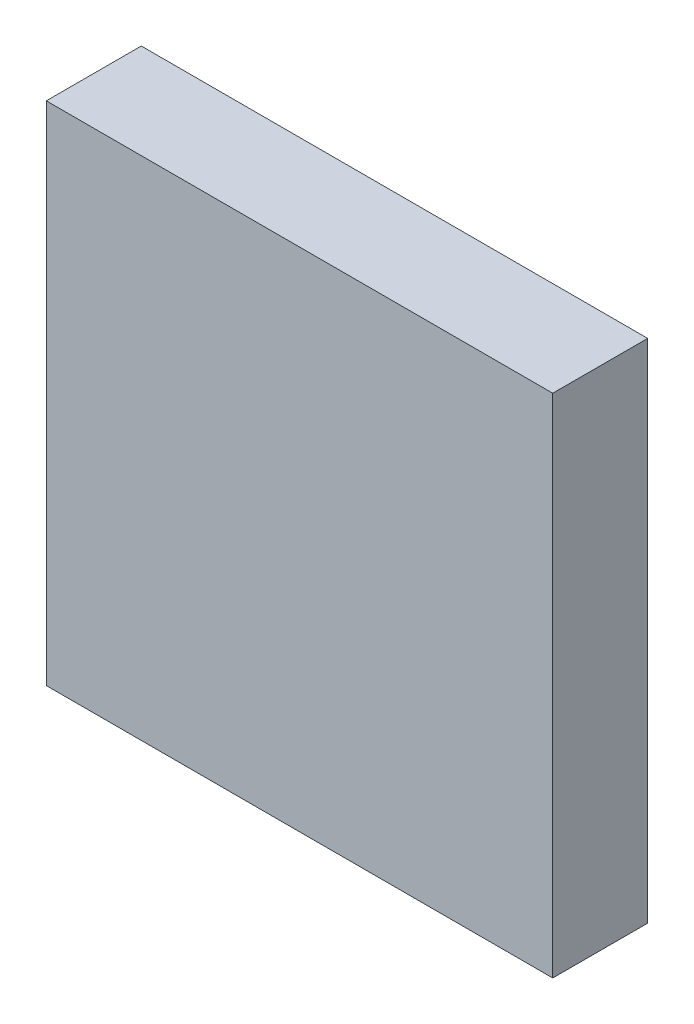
from build123d import *

# Parameters (mm, degrees)
SKETCH1_W      = 101.6
SKETCH1_H      = 19.05
EXTRUDE1_DEPTH = 101.6


with BuildPart() as part:
    # Sketch1 → Extrude1 (new body)
    with BuildSketch(Plane(origin=(0, 0, 0), x_dir=(1, 0, 0), z_dir=(0, 1, 0))):
        with Locations((50.8, 9.525)):
            Rectangle(SKETCH1_W, SKETCH1_H)
    extrude(amount=-EXTRUDE1_DEPTH)


solid = part.part
